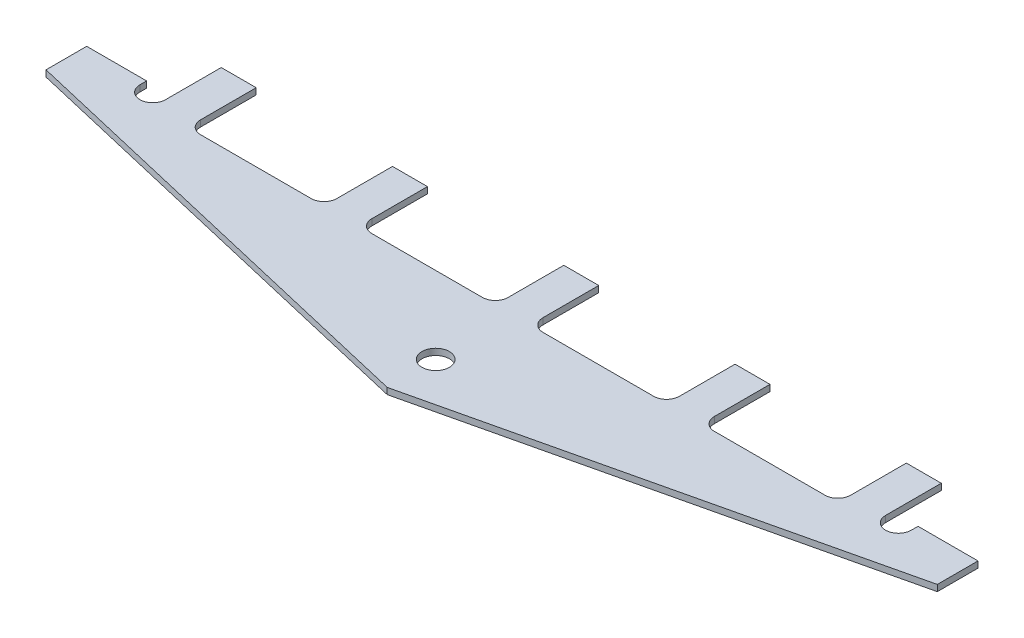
ISO-10303-21;
HEADER;
FILE_DESCRIPTION(('STEP AP214'),'2;1');
FILE_NAME('part.step','',(''),(''),'','','');
FILE_SCHEMA(('AUTOMOTIVE_DESIGN { 1 0 10303 214 1 1 1 1 }'));
ENDSEC;
DATA;
#1=APPLICATION_CONTEXT('core data for automotive mechanical design processes');
#2=APPLICATION_PROTOCOL_DEFINITION('international standard','automotive_design',2000,#1);
#3=PRODUCT_CONTEXT('',#1,'mechanical');
#4=PRODUCT('Part','Part','',(#3));
#5=PRODUCT_RELATED_PRODUCT_CATEGORY('part','',(#4));
#6=PRODUCT_DEFINITION_FORMATION('','',#4);
#7=PRODUCT_DEFINITION_CONTEXT('part definition',#1,'design');
#8=PRODUCT_DEFINITION('design','',#6,#7);
#9=PRODUCT_DEFINITION_SHAPE('','',#8);
#10=(LENGTH_UNIT() NAMED_UNIT(*) SI_UNIT(.MILLI.,.METRE.));
#11=(NAMED_UNIT(*) PLANE_ANGLE_UNIT() SI_UNIT($,.RADIAN.));
#12=(NAMED_UNIT(*) SI_UNIT($,.STERADIAN.) SOLID_ANGLE_UNIT());
#13=UNCERTAINTY_MEASURE_WITH_UNIT(LENGTH_MEASURE(1.E-05),#10,'distance_accuracy_value','');
#14=(GEOMETRIC_REPRESENTATION_CONTEXT(3) GLOBAL_UNCERTAINTY_ASSIGNED_CONTEXT((#13)) GLOBAL_UNIT_ASSIGNED_CONTEXT((#10,
#11,#12)) REPRESENTATION_CONTEXT('',''));
#15=CARTESIAN_POINT('',(0.,0.,0.));
#16=DIRECTION('',(0.,0.,1.));
#17=DIRECTION('',(1.,0.,0.));
#18=AXIS2_PLACEMENT_3D('',#15,#16,#17);
#19=CARTESIAN_POINT('',(-3.2385,-1.1684,-26.9875));
#20=DIRECTION('',(-1.,0.,0.));
#21=DIRECTION('',(0.,0.,1.));
#22=AXIS2_PLACEMENT_3D('',#19,#20,#21);
#23=PLANE('',#22);
#24=DIRECTION('',(0.,0.,1.));
#25=VECTOR('',#24,1.);
#26=CARTESIAN_POINT('',(-3.2385,0.,-26.9875));
#27=LINE('',#26,#25);
#28=CARTESIAN_POINT('',(-3.2385,0.,-26.9875));
#29=VERTEX_POINT('',#28);
#30=CARTESIAN_POINT('',(-3.2385,0.,-16.66875));
#31=VERTEX_POINT('',#30);
#32=EDGE_CURVE('E310',#29,#31,#27,.T.);
#33=ORIENTED_EDGE('',*,*,#32,.F.);
#34=DIRECTION('',(0.,1.,0.));
#35=VECTOR('',#34,1.);
#36=CARTESIAN_POINT('',(-3.2385,-1.1684,-26.9875));
#37=LINE('',#36,#35);
#38=CARTESIAN_POINT('',(-3.2385,-1.1684,-26.9875));
#39=VERTEX_POINT('',#38);
#40=EDGE_CURVE('E11',#39,#29,#37,.T.);
#41=ORIENTED_EDGE('',*,*,#40,.F.);
#42=DIRECTION('',(0.,0.,1.));
#43=VECTOR('',#42,1.);
#44=CARTESIAN_POINT('',(-3.2385,-1.1684,-26.9875));
#45=LINE('',#44,#43);
#46=CARTESIAN_POINT('',(-3.2385,-1.1684,-16.66875));
#47=VERTEX_POINT('',#46);
#48=EDGE_CURVE('E418',#39,#47,#45,.T.);
#49=ORIENTED_EDGE('',*,*,#48,.T.);
#50=DIRECTION('',(0.,1.,0.));
#51=VECTOR('',#50,1.);
#52=CARTESIAN_POINT('',(-3.2385,-1.1684,-16.66875));
#53=LINE('',#52,#51);
#54=EDGE_CURVE('E42',#47,#31,#53,.T.);
#55=ORIENTED_EDGE('',*,*,#54,.T.);
#56=EDGE_LOOP('',(#33,#41,#49,#55));
#57=FACE_BOUND('',#56,.T.);
#58=ADVANCED_FACE('F39',(#57),#23,.T.);
#59=CARTESIAN_POINT('',(-3.2385,-1.1684,-26.9875));
#60=DIRECTION('',(0.,0.,-1.));
#61=DIRECTION('',(-1.,0.,0.));
#62=AXIS2_PLACEMENT_3D('',#59,#60,#61);
#63=PLANE('',#62);
#64=DIRECTION('',(-1.,0.,0.));
#65=VECTOR('',#64,1.);
#66=CARTESIAN_POINT('',(-3.2385,0.,-26.9875));
#67=LINE('',#66,#65);
#68=CARTESIAN_POINT('',(3.2385,0.,-26.9875));
#69=VERTEX_POINT('',#68);
#70=EDGE_CURVE('E416',#69,#29,#67,.T.);
#71=ORIENTED_EDGE('',*,*,#70,.F.);
#72=DIRECTION('',(0.,1.,0.));
#73=VECTOR('',#72,1.);
#74=CARTESIAN_POINT('',(3.2385,-1.1684,-26.9875));
#75=LINE('',#74,#73);
#76=CARTESIAN_POINT('',(3.2385,-1.1684,-26.9875));
#77=VERTEX_POINT('',#76);
#78=EDGE_CURVE('E48',#77,#69,#75,.T.);
#79=ORIENTED_EDGE('',*,*,#78,.F.);
#80=DIRECTION('',(-1.,0.,0.));
#81=VECTOR('',#80,1.);
#82=CARTESIAN_POINT('',(-3.2385,-1.1684,-26.9875));
#83=LINE('',#82,#81);
#84=EDGE_CURVE('E300',#77,#39,#83,.T.);
#85=ORIENTED_EDGE('',*,*,#84,.T.);
#86=ORIENTED_EDGE('',*,*,#40,.T.);
#87=EDGE_LOOP('',(#71,#79,#85,#86));
#88=FACE_BOUND('',#87,.T.);
#89=ADVANCED_FACE('F488',(#88),#63,.T.);
#90=CARTESIAN_POINT('',(3.2385,-1.1684,-26.9875));
#91=DIRECTION('',(1.,0.,0.));
#92=DIRECTION('',(0.,0.,-1.));
#93=AXIS2_PLACEMENT_3D('',#90,#91,#92);
#94=PLANE('',#93);
#95=DIRECTION('',(0.,0.,-1.));
#96=VECTOR('',#95,1.);
#97=CARTESIAN_POINT('',(3.2385,0.,-26.9875));
#98=LINE('',#97,#96);
#99=CARTESIAN_POINT('',(3.2385,0.,-16.66875));
#100=VERTEX_POINT('',#99);
#101=EDGE_CURVE('E287',#100,#69,#98,.T.);
#102=ORIENTED_EDGE('',*,*,#101,.F.);
#103=DIRECTION('',(0.,1.,0.));
#104=VECTOR('',#103,1.);
#105=CARTESIAN_POINT('',(3.2385,-1.1684,-16.66875));
#106=LINE('',#105,#104);
#107=CARTESIAN_POINT('',(3.2385,-1.1684,-16.66875));
#108=VERTEX_POINT('',#107);
#109=EDGE_CURVE('E282',#108,#100,#106,.T.);
#110=ORIENTED_EDGE('',*,*,#109,.F.);
#111=DIRECTION('',(0.,0.,-1.));
#112=VECTOR('',#111,1.);
#113=CARTESIAN_POINT('',(3.2385,-1.1684,-26.9875));
#114=LINE('',#113,#112);
#115=EDGE_CURVE('E285',#108,#77,#114,.T.);
#116=ORIENTED_EDGE('',*,*,#115,.T.);
#117=ORIENTED_EDGE('',*,*,#78,.T.);
#118=EDGE_LOOP('',(#102,#110,#116,#117));
#119=FACE_BOUND('',#118,.T.);
#120=ADVANCED_FACE('F284',(#119),#94,.T.);
#121=CARTESIAN_POINT('',(5.61975,-1.1684,-16.66875));
#122=DIRECTION('',(0.,1.,0.));
#123=DIRECTION('',(0.,0.,1.));
#124=AXIS2_PLACEMENT_3D('',#121,#122,#123);
#125=CYLINDRICAL_SURFACE('',#124,2.38125);
#126=CARTESIAN_POINT('',(5.61975,0.,-16.66875));
#127=DIRECTION('',(0.,-1.,0.));
#128=DIRECTION('',(0.,0.,1.));
#129=AXIS2_PLACEMENT_3D('',#126,#127,#128);
#130=CIRCLE('',#129,2.38125);
#131=CARTESIAN_POINT('',(5.61975,0.,-14.2875));
#132=VERTEX_POINT('',#131);
#133=EDGE_CURVE('E413',#132,#100,#130,.T.);
#134=ORIENTED_EDGE('',*,*,#133,.F.);
#135=DIRECTION('',(0.,1.,0.));
#136=VECTOR('',#135,1.);
#137=CARTESIAN_POINT('',(5.61975,-1.1684,-14.2875));
#138=LINE('',#137,#136);
#139=CARTESIAN_POINT('',(5.61975,-1.1684,-14.2875));
#140=VERTEX_POINT('',#139);
#141=EDGE_CURVE('E292',#140,#132,#138,.T.);
#142=ORIENTED_EDGE('',*,*,#141,.F.);
#143=CARTESIAN_POINT('',(5.61975,-1.1684,-16.66875));
#144=DIRECTION('',(0.,-1.,0.));
#145=DIRECTION('',(0.,0.,1.));
#146=AXIS2_PLACEMENT_3D('',#143,#144,#145);
#147=CIRCLE('',#146,2.38125);
#148=EDGE_CURVE('E298',#140,#108,#147,.T.);
#149=ORIENTED_EDGE('',*,*,#148,.T.);
#150=ORIENTED_EDGE('',*,*,#109,.T.);
#151=EDGE_LOOP('',(#134,#142,#149,#150));
#152=FACE_BOUND('',#151,.T.);
#153=ADVANCED_FACE('F302',(#152),#125,.F.);
#154=CARTESIAN_POINT('',(5.61975,-1.1684,-14.2875));
#155=DIRECTION('',(0.,0.,-1.));
#156=DIRECTION('',(-1.,0.,0.));
#157=AXIS2_PLACEMENT_3D('',#154,#155,#156);
#158=PLANE('',#157);
#159=DIRECTION('',(-1.,0.,0.));
#160=VECTOR('',#159,1.);
#161=CARTESIAN_POINT('',(5.61975,0.,-14.2875));
#162=LINE('',#161,#160);
#163=CARTESIAN_POINT('',(26.13025,0.,-14.2875));
#164=VERTEX_POINT('',#163);
#165=EDGE_CURVE('E410',#164,#132,#162,.T.);
#166=ORIENTED_EDGE('',*,*,#165,.F.);
#167=DIRECTION('',(0.,1.,0.));
#168=VECTOR('',#167,1.);
#169=CARTESIAN_POINT('',(26.13025,-1.1684,-14.2875));
#170=LINE('',#169,#168);
#171=CARTESIAN_POINT('',(26.13025,-1.1684,-14.2875));
#172=VERTEX_POINT('',#171);
#173=EDGE_CURVE('E422',#172,#164,#170,.T.);
#174=ORIENTED_EDGE('',*,*,#173,.F.);
#175=DIRECTION('',(-1.,0.,0.));
#176=VECTOR('',#175,1.);
#177=CARTESIAN_POINT('',(5.61975,-1.1684,-14.2875));
#178=LINE('',#177,#176);
#179=EDGE_CURVE('E303',#172,#140,#178,.T.);
#180=ORIENTED_EDGE('',*,*,#179,.T.);
#181=ORIENTED_EDGE('',*,*,#141,.T.);
#182=EDGE_LOOP('',(#166,#174,#180,#181));
#183=FACE_BOUND('',#182,.T.);
#184=ADVANCED_FACE('F501',(#183),#158,.T.);
#185=CARTESIAN_POINT('',(26.13025,-1.1684,-16.66875));
#186=DIRECTION('',(0.,1.,0.));
#187=DIRECTION('',(0.,0.,1.));
#188=AXIS2_PLACEMENT_3D('',#185,#186,#187);
#189=CYLINDRICAL_SURFACE('',#188,2.38125);
#190=CARTESIAN_POINT('',(26.13025,0.,-16.66875));
#191=DIRECTION('',(0.,-1.,0.));
#192=DIRECTION('',(0.,0.,1.));
#193=AXIS2_PLACEMENT_3D('',#190,#191,#192);
#194=CIRCLE('',#193,2.38125);
#195=CARTESIAN_POINT('',(28.5115,0.,-16.66875));
#196=VERTEX_POINT('',#195);
#197=EDGE_CURVE('E407',#196,#164,#194,.T.);
#198=ORIENTED_EDGE('',*,*,#197,.F.);
#199=DIRECTION('',(0.,1.,0.));
#200=VECTOR('',#199,1.);
#201=CARTESIAN_POINT('',(28.5115,-1.1684,-16.66875));
#202=LINE('',#201,#200);
#203=CARTESIAN_POINT('',(28.5115,-1.1684,-16.66875));
#204=VERTEX_POINT('',#203);
#205=EDGE_CURVE('E424',#204,#196,#202,.T.);
#206=ORIENTED_EDGE('',*,*,#205,.F.);
#207=CARTESIAN_POINT('',(26.13025,-1.1684,-16.66875));
#208=DIRECTION('',(0.,-1.,0.));
#209=DIRECTION('',(0.,0.,1.));
#210=AXIS2_PLACEMENT_3D('',#207,#208,#209);
#211=CIRCLE('',#210,2.38125);
#212=EDGE_CURVE('E305',#204,#172,#211,.T.);
#213=ORIENTED_EDGE('',*,*,#212,.T.);
#214=ORIENTED_EDGE('',*,*,#173,.T.);
#215=EDGE_LOOP('',(#198,#206,#213,#214));
#216=FACE_BOUND('',#215,.T.);
#217=ADVANCED_FACE('F504',(#216),#189,.F.);
#218=CARTESIAN_POINT('',(28.5115,-1.1684,-16.66875));
#219=DIRECTION('',(-1.,0.,0.));
#220=DIRECTION('',(0.,0.,1.));
#221=AXIS2_PLACEMENT_3D('',#218,#219,#220);
#222=PLANE('',#221);
#223=DIRECTION('',(0.,0.,1.));
#224=VECTOR('',#223,1.);
#225=CARTESIAN_POINT('',(28.5115,0.,-16.66875));
#226=LINE('',#225,#224);
#227=CARTESIAN_POINT('',(28.5115,0.,-26.9875));
#228=VERTEX_POINT('',#227);
#229=EDGE_CURVE('E404',#228,#196,#226,.T.);
#230=ORIENTED_EDGE('',*,*,#229,.F.);
#231=DIRECTION('',(0.,1.,0.));
#232=VECTOR('',#231,1.);
#233=CARTESIAN_POINT('',(28.5115,-1.1684,-26.9875));
#234=LINE('',#233,#232);
#235=CARTESIAN_POINT('',(28.5115,-1.1684,-26.9875));
#236=VERTEX_POINT('',#235);
#237=EDGE_CURVE('E426',#236,#228,#234,.T.);
#238=ORIENTED_EDGE('',*,*,#237,.F.);
#239=DIRECTION('',(0.,0.,1.));
#240=VECTOR('',#239,1.);
#241=CARTESIAN_POINT('',(28.5115,-1.1684,-16.66875));
#242=LINE('',#241,#240);
#243=EDGE_CURVE('E742',#236,#204,#242,.T.);
#244=ORIENTED_EDGE('',*,*,#243,.T.);
#245=ORIENTED_EDGE('',*,*,#205,.T.);
#246=EDGE_LOOP('',(#230,#238,#244,#245));
#247=FACE_BOUND('',#246,.T.);
#248=ADVANCED_FACE('F508',(#247),#222,.T.);
#249=CARTESIAN_POINT('',(28.5115,-1.1684,-26.9875));
#250=DIRECTION('',(0.,0.,-1.));
#251=DIRECTION('',(-1.,0.,0.));
#252=AXIS2_PLACEMENT_3D('',#249,#250,#251);
#253=PLANE('',#252);
#254=DIRECTION('',(-1.,0.,0.));
#255=VECTOR('',#254,1.);
#256=CARTESIAN_POINT('',(28.5115,0.,-26.9875));
#257=LINE('',#256,#255);
#258=CARTESIAN_POINT('',(34.9885,0.,-26.9875));
#259=VERTEX_POINT('',#258);
#260=EDGE_CURVE('E401',#259,#228,#257,.T.);
#261=ORIENTED_EDGE('',*,*,#260,.F.);
#262=DIRECTION('',(0.,1.,0.));
#263=VECTOR('',#262,1.);
#264=CARTESIAN_POINT('',(34.9885,-1.1684,-26.9875));
#265=LINE('',#264,#263);
#266=CARTESIAN_POINT('',(34.9885,-1.1684,-26.9875));
#267=VERTEX_POINT('',#266);
#268=EDGE_CURVE('E428',#267,#259,#265,.T.);
#269=ORIENTED_EDGE('',*,*,#268,.F.);
#270=DIRECTION('',(-1.,0.,0.));
#271=VECTOR('',#270,1.);
#272=CARTESIAN_POINT('',(28.5115,-1.1684,-26.9875));
#273=LINE('',#272,#271);
#274=EDGE_CURVE('E739',#267,#236,#273,.T.);
#275=ORIENTED_EDGE('',*,*,#274,.T.);
#276=ORIENTED_EDGE('',*,*,#237,.T.);
#277=EDGE_LOOP('',(#261,#269,#275,#276));
#278=FACE_BOUND('',#277,.T.);
#279=ADVANCED_FACE('F512',(#278),#253,.T.);
#280=CARTESIAN_POINT('',(34.9885,-1.1684,-26.9875));
#281=DIRECTION('',(1.,0.,0.));
#282=DIRECTION('',(0.,0.,-1.));
#283=AXIS2_PLACEMENT_3D('',#280,#281,#282);
#284=PLANE('',#283);
#285=DIRECTION('',(0.,0.,-1.));
#286=VECTOR('',#285,1.);
#287=CARTESIAN_POINT('',(34.9885,0.,-26.9875));
#288=LINE('',#287,#286);
#289=CARTESIAN_POINT('',(34.9885,0.,-16.66875));
#290=VERTEX_POINT('',#289);
#291=EDGE_CURVE('E398',#290,#259,#288,.T.);
#292=ORIENTED_EDGE('',*,*,#291,.F.);
#293=DIRECTION('',(0.,1.,0.));
#294=VECTOR('',#293,1.);
#295=CARTESIAN_POINT('',(34.9885,-1.1684,-16.66875));
#296=LINE('',#295,#294);
#297=CARTESIAN_POINT('',(34.9885,-1.1684,-16.66875));
#298=VERTEX_POINT('',#297);
#299=EDGE_CURVE('E430',#298,#290,#296,.T.);
#300=ORIENTED_EDGE('',*,*,#299,.F.);
#301=DIRECTION('',(0.,0.,-1.));
#302=VECTOR('',#301,1.);
#303=CARTESIAN_POINT('',(34.9885,-1.1684,-26.9875));
#304=LINE('',#303,#302);
#305=EDGE_CURVE('E736',#298,#267,#304,.T.);
#306=ORIENTED_EDGE('',*,*,#305,.T.);
#307=ORIENTED_EDGE('',*,*,#268,.T.);
#308=EDGE_LOOP('',(#292,#300,#306,#307));
#309=FACE_BOUND('',#308,.T.);
#310=ADVANCED_FACE('F516',(#309),#284,.T.);
#311=CARTESIAN_POINT('',(37.36975,-1.1684,-16.66875));
#312=DIRECTION('',(0.,1.,0.));
#313=DIRECTION('',(0.,0.,1.));
#314=AXIS2_PLACEMENT_3D('',#311,#312,#313);
#315=CYLINDRICAL_SURFACE('',#314,2.38125);
#316=CARTESIAN_POINT('',(37.36975,0.,-16.66875));
#317=DIRECTION('',(0.,-1.,0.));
#318=DIRECTION('',(0.,0.,1.));
#319=AXIS2_PLACEMENT_3D('',#316,#317,#318);
#320=CIRCLE('',#319,2.38125);
#321=CARTESIAN_POINT('',(37.36975,0.,-14.2875));
#322=VERTEX_POINT('',#321);
#323=EDGE_CURVE('E395',#322,#290,#320,.T.);
#324=ORIENTED_EDGE('',*,*,#323,.F.);
#325=DIRECTION('',(0.,1.,0.));
#326=VECTOR('',#325,1.);
#327=CARTESIAN_POINT('',(37.36975,-1.1684,-14.2875));
#328=LINE('',#327,#326);
#329=CARTESIAN_POINT('',(37.36975,-1.1684,-14.2875));
#330=VERTEX_POINT('',#329);
#331=EDGE_CURVE('E432',#330,#322,#328,.T.);
#332=ORIENTED_EDGE('',*,*,#331,.F.);
#333=CARTESIAN_POINT('',(37.36975,-1.1684,-16.66875));
#334=DIRECTION('',(0.,-1.,0.));
#335=DIRECTION('',(0.,0.,1.));
#336=AXIS2_PLACEMENT_3D('',#333,#334,#335);
#337=CIRCLE('',#336,2.38125);
#338=EDGE_CURVE('E733',#330,#298,#337,.T.);
#339=ORIENTED_EDGE('',*,*,#338,.T.);
#340=ORIENTED_EDGE('',*,*,#299,.T.);
#341=EDGE_LOOP('',(#324,#332,#339,#340));
#342=FACE_BOUND('',#341,.T.);
#343=ADVANCED_FACE('F520',(#342),#315,.F.);
#344=CARTESIAN_POINT('',(37.36975,-1.1684,-14.2875));
#345=DIRECTION('',(0.,0.,-1.));
#346=DIRECTION('',(-1.,0.,0.));
#347=AXIS2_PLACEMENT_3D('',#344,#345,#346);
#348=PLANE('',#347);
#349=DIRECTION('',(-1.,0.,0.));
#350=VECTOR('',#349,1.);
#351=CARTESIAN_POINT('',(37.36975,0.,-14.2875));
#352=LINE('',#351,#350);
#353=CARTESIAN_POINT('',(57.88025,0.,-14.2875));
#354=VERTEX_POINT('',#353);
#355=EDGE_CURVE('E392',#354,#322,#352,.T.);
#356=ORIENTED_EDGE('',*,*,#355,.F.);
#357=DIRECTION('',(0.,1.,0.));
#358=VECTOR('',#357,1.);
#359=CARTESIAN_POINT('',(57.88025,-1.1684,-14.2875));
#360=LINE('',#359,#358);
#361=CARTESIAN_POINT('',(57.88025,-1.1684,-14.2875));
#362=VERTEX_POINT('',#361);
#363=EDGE_CURVE('E434',#362,#354,#360,.T.);
#364=ORIENTED_EDGE('',*,*,#363,.F.);
#365=DIRECTION('',(-1.,0.,0.));
#366=VECTOR('',#365,1.);
#367=CARTESIAN_POINT('',(37.36975,-1.1684,-14.2875));
#368=LINE('',#367,#366);
#369=EDGE_CURVE('E730',#362,#330,#368,.T.);
#370=ORIENTED_EDGE('',*,*,#369,.T.);
#371=ORIENTED_EDGE('',*,*,#331,.T.);
#372=EDGE_LOOP('',(#356,#364,#370,#371));
#373=FACE_BOUND('',#372,.T.);
#374=ADVANCED_FACE('F524',(#373),#348,.T.);
#375=CARTESIAN_POINT('',(57.88025,-1.1684,-16.66875));
#376=DIRECTION('',(0.,1.,0.));
#377=DIRECTION('',(0.,0.,1.));
#378=AXIS2_PLACEMENT_3D('',#375,#376,#377);
#379=CYLINDRICAL_SURFACE('',#378,2.38125);
#380=CARTESIAN_POINT('',(57.88025,0.,-16.66875));
#381=DIRECTION('',(0.,-1.,0.));
#382=DIRECTION('',(0.,0.,1.));
#383=AXIS2_PLACEMENT_3D('',#380,#381,#382);
#384=CIRCLE('',#383,2.38125);
#385=CARTESIAN_POINT('',(60.2615,0.,-16.66875));
#386=VERTEX_POINT('',#385);
#387=EDGE_CURVE('E389',#386,#354,#384,.T.);
#388=ORIENTED_EDGE('',*,*,#387,.F.);
#389=DIRECTION('',(0.,1.,0.));
#390=VECTOR('',#389,1.);
#391=CARTESIAN_POINT('',(60.2615,-1.1684,-16.66875));
#392=LINE('',#391,#390);
#393=CARTESIAN_POINT('',(60.2615,-1.1684,-16.66875));
#394=VERTEX_POINT('',#393);
#395=EDGE_CURVE('E436',#394,#386,#392,.T.);
#396=ORIENTED_EDGE('',*,*,#395,.F.);
#397=CARTESIAN_POINT('',(57.88025,-1.1684,-16.66875));
#398=DIRECTION('',(0.,-1.,0.));
#399=DIRECTION('',(0.,0.,1.));
#400=AXIS2_PLACEMENT_3D('',#397,#398,#399);
#401=CIRCLE('',#400,2.38125);
#402=EDGE_CURVE('E727',#394,#362,#401,.T.);
#403=ORIENTED_EDGE('',*,*,#402,.T.);
#404=ORIENTED_EDGE('',*,*,#363,.T.);
#405=EDGE_LOOP('',(#388,#396,#403,#404));
#406=FACE_BOUND('',#405,.T.);
#407=ADVANCED_FACE('F528',(#406),#379,.F.);
#408=CARTESIAN_POINT('',(60.2615,-1.1684,-16.66875));
#409=DIRECTION('',(-1.,0.,0.));
#410=DIRECTION('',(0.,0.,1.));
#411=AXIS2_PLACEMENT_3D('',#408,#409,#410);
#412=PLANE('',#411);
#413=DIRECTION('',(0.,0.,1.));
#414=VECTOR('',#413,1.);
#415=CARTESIAN_POINT('',(60.2615,0.,-16.66875));
#416=LINE('',#415,#414);
#417=CARTESIAN_POINT('',(60.2615,0.,-26.9875));
#418=VERTEX_POINT('',#417);
#419=EDGE_CURVE('E386',#418,#386,#416,.T.);
#420=ORIENTED_EDGE('',*,*,#419,.F.);
#421=DIRECTION('',(0.,1.,0.));
#422=VECTOR('',#421,1.);
#423=CARTESIAN_POINT('',(60.2615,-1.1684,-26.9875));
#424=LINE('',#423,#422);
#425=CARTESIAN_POINT('',(60.2615,-1.1684,-26.9875));
#426=VERTEX_POINT('',#425);
#427=EDGE_CURVE('E438',#426,#418,#424,.T.);
#428=ORIENTED_EDGE('',*,*,#427,.F.);
#429=DIRECTION('',(0.,0.,1.));
#430=VECTOR('',#429,1.);
#431=CARTESIAN_POINT('',(60.2615,-1.1684,-16.66875));
#432=LINE('',#431,#430);
#433=EDGE_CURVE('E724',#426,#394,#432,.T.);
#434=ORIENTED_EDGE('',*,*,#433,.T.);
#435=ORIENTED_EDGE('',*,*,#395,.T.);
#436=EDGE_LOOP('',(#420,#428,#434,#435));
#437=FACE_BOUND('',#436,.T.);
#438=ADVANCED_FACE('F532',(#437),#412,.T.);
#439=CARTESIAN_POINT('',(60.2615,-1.1684,-26.9875));
#440=DIRECTION('',(0.,0.,-1.));
#441=DIRECTION('',(-1.,0.,0.));
#442=AXIS2_PLACEMENT_3D('',#439,#440,#441);
#443=PLANE('',#442);
#444=DIRECTION('',(-1.,0.,0.));
#445=VECTOR('',#444,1.);
#446=CARTESIAN_POINT('',(60.2615,0.,-26.9875));
#447=LINE('',#446,#445);
#448=CARTESIAN_POINT('',(66.7385,0.,-26.9875));
#449=VERTEX_POINT('',#448);
#450=EDGE_CURVE('E383',#449,#418,#447,.T.);
#451=ORIENTED_EDGE('',*,*,#450,.F.);
#452=DIRECTION('',(0.,1.,0.));
#453=VECTOR('',#452,1.);
#454=CARTESIAN_POINT('',(66.7385,-1.1684,-26.9875));
#455=LINE('',#454,#453);
#456=CARTESIAN_POINT('',(66.7385,-1.1684,-26.9875));
#457=VERTEX_POINT('',#456);
#458=EDGE_CURVE('E440',#457,#449,#455,.T.);
#459=ORIENTED_EDGE('',*,*,#458,.F.);
#460=DIRECTION('',(-1.,0.,0.));
#461=VECTOR('',#460,1.);
#462=CARTESIAN_POINT('',(60.2615,-1.1684,-26.9875));
#463=LINE('',#462,#461);
#464=EDGE_CURVE('E721',#457,#426,#463,.T.);
#465=ORIENTED_EDGE('',*,*,#464,.T.);
#466=ORIENTED_EDGE('',*,*,#427,.T.);
#467=EDGE_LOOP('',(#451,#459,#465,#466));
#468=FACE_BOUND('',#467,.T.);
#469=ADVANCED_FACE('F536',(#468),#443,.T.);
#470=CARTESIAN_POINT('',(66.7385,-1.1684,-26.9875));
#471=DIRECTION('',(1.,0.,0.));
#472=DIRECTION('',(0.,0.,-1.));
#473=AXIS2_PLACEMENT_3D('',#470,#471,#472);
#474=PLANE('',#473);
#475=DIRECTION('',(0.,0.,-1.));
#476=VECTOR('',#475,1.);
#477=CARTESIAN_POINT('',(66.7385,0.,-26.9875));
#478=LINE('',#477,#476);
#479=CARTESIAN_POINT('',(66.7385,0.,-16.66875));
#480=VERTEX_POINT('',#479);
#481=EDGE_CURVE('E380',#480,#449,#478,.T.);
#482=ORIENTED_EDGE('',*,*,#481,.F.);
#483=DIRECTION('',(0.,1.,0.));
#484=VECTOR('',#483,1.);
#485=CARTESIAN_POINT('',(66.7385,-1.1684,-16.66875));
#486=LINE('',#485,#484);
#487=CARTESIAN_POINT('',(66.7385,-1.1684,-16.66875));
#488=VERTEX_POINT('',#487);
#489=EDGE_CURVE('E442',#488,#480,#486,.T.);
#490=ORIENTED_EDGE('',*,*,#489,.F.);
#491=DIRECTION('',(0.,0.,-1.));
#492=VECTOR('',#491,1.);
#493=CARTESIAN_POINT('',(66.7385,-1.1684,-26.9875));
#494=LINE('',#493,#492);
#495=EDGE_CURVE('E718',#488,#457,#494,.T.);
#496=ORIENTED_EDGE('',*,*,#495,.T.);
#497=ORIENTED_EDGE('',*,*,#458,.T.);
#498=EDGE_LOOP('',(#482,#490,#496,#497));
#499=FACE_BOUND('',#498,.T.);
#500=ADVANCED_FACE('F540',(#499),#474,.T.);
#501=CARTESIAN_POINT('',(69.11975,-1.1684,-16.66875));
#502=DIRECTION('',(0.,1.,0.));
#503=DIRECTION('',(0.,0.,1.));
#504=AXIS2_PLACEMENT_3D('',#501,#502,#503);
#505=CYLINDRICAL_SURFACE('',#504,2.38125);
#506=CARTESIAN_POINT('',(69.11975,0.,-16.66875));
#507=DIRECTION('',(0.,-1.,0.));
#508=DIRECTION('',(0.,0.,1.));
#509=AXIS2_PLACEMENT_3D('',#506,#507,#508);
#510=CIRCLE('',#509,2.38125);
#511=CARTESIAN_POINT('',(71.501,0.,-16.66875));
#512=VERTEX_POINT('',#511);
#513=EDGE_CURVE('E377',#512,#480,#510,.T.);
#514=ORIENTED_EDGE('',*,*,#513,.F.);
#515=DIRECTION('',(0.,1.,0.));
#516=VECTOR('',#515,1.);
#517=CARTESIAN_POINT('',(71.501,-1.1684,-16.66875));
#518=LINE('',#517,#516);
#519=CARTESIAN_POINT('',(71.501,-1.1684,-16.66875));
#520=VERTEX_POINT('',#519);
#521=EDGE_CURVE('E444',#520,#512,#518,.T.);
#522=ORIENTED_EDGE('',*,*,#521,.F.);
#523=CARTESIAN_POINT('',(69.11975,-1.1684,-16.66875));
#524=DIRECTION('',(0.,-1.,0.));
#525=DIRECTION('',(0.,0.,1.));
#526=AXIS2_PLACEMENT_3D('',#523,#524,#525);
#527=CIRCLE('',#526,2.38125);
#528=EDGE_CURVE('E715',#520,#488,#527,.T.);
#529=ORIENTED_EDGE('',*,*,#528,.T.);
#530=ORIENTED_EDGE('',*,*,#489,.T.);
#531=EDGE_LOOP('',(#514,#522,#529,#530));
#532=FACE_BOUND('',#531,.T.);
#533=ADVANCED_FACE('F544',(#532),#505,.F.);
#534=CARTESIAN_POINT('',(71.501,-1.1684,-16.66875));
#535=DIRECTION('',(-1.,0.,0.));
#536=DIRECTION('',(0.,0.,1.));
#537=AXIS2_PLACEMENT_3D('',#534,#535,#536);
#538=PLANE('',#537);
#539=DIRECTION('',(0.,0.,1.));
#540=VECTOR('',#539,1.);
#541=CARTESIAN_POINT('',(71.501,0.,-16.66875));
#542=LINE('',#541,#540);
#543=CARTESIAN_POINT('',(71.501,0.,-17.9197));
#544=VERTEX_POINT('',#543);
#545=EDGE_CURVE('E374',#544,#512,#542,.T.);
#546=ORIENTED_EDGE('',*,*,#545,.F.);
#547=DIRECTION('',(0.,1.,0.));
#548=VECTOR('',#547,1.);
#549=CARTESIAN_POINT('',(71.501,-1.1684,-17.9197));
#550=LINE('',#549,#548);
#551=CARTESIAN_POINT('',(71.501,-1.1684,-17.9197));
#552=VERTEX_POINT('',#551);
#553=EDGE_CURVE('E446',#552,#544,#550,.T.);
#554=ORIENTED_EDGE('',*,*,#553,.F.);
#555=DIRECTION('',(0.,0.,1.));
#556=VECTOR('',#555,1.);
#557=CARTESIAN_POINT('',(71.501,-1.1684,-16.66875));
#558=LINE('',#557,#556);
#559=EDGE_CURVE('E712',#552,#520,#558,.T.);
#560=ORIENTED_EDGE('',*,*,#559,.T.);
#561=ORIENTED_EDGE('',*,*,#521,.T.);
#562=EDGE_LOOP('',(#546,#554,#560,#561));
#563=FACE_BOUND('',#562,.T.);
#564=ADVANCED_FACE('F548',(#563),#538,.T.);
#565=CARTESIAN_POINT('',(71.501,-1.1684,-17.9197));
#566=DIRECTION('',(0.,0.,-1.));
#567=DIRECTION('',(-1.,0.,0.));
#568=AXIS2_PLACEMENT_3D('',#565,#566,#567);
#569=PLANE('',#568);
#570=DIRECTION('',(-1.,0.,0.));
#571=VECTOR('',#570,1.);
#572=CARTESIAN_POINT('',(71.501,0.,-17.9197));
#573=LINE('',#572,#571);
#574=CARTESIAN_POINT('',(82.6135,0.,-17.9197));
#575=VERTEX_POINT('',#574);
#576=EDGE_CURVE('E371',#575,#544,#573,.T.);
#577=ORIENTED_EDGE('',*,*,#576,.F.);
#578=DIRECTION('',(0.,1.,0.));
#579=VECTOR('',#578,1.);
#580=CARTESIAN_POINT('',(82.6135,-1.1684,-17.9197));
#581=LINE('',#580,#579);
#582=CARTESIAN_POINT('',(82.6135,-1.1684,-17.9197));
#583=VERTEX_POINT('',#582);
#584=EDGE_CURVE('E448',#583,#575,#581,.T.);
#585=ORIENTED_EDGE('',*,*,#584,.F.);
#586=DIRECTION('',(-1.,0.,0.));
#587=VECTOR('',#586,1.);
#588=CARTESIAN_POINT('',(71.501,-1.1684,-17.9197));
#589=LINE('',#588,#587);
#590=EDGE_CURVE('E709',#583,#552,#589,.T.);
#591=ORIENTED_EDGE('',*,*,#590,.T.);
#592=ORIENTED_EDGE('',*,*,#553,.T.);
#593=EDGE_LOOP('',(#577,#585,#591,#592));
#594=FACE_BOUND('',#593,.T.);
#595=ADVANCED_FACE('F552',(#594),#569,.T.);
#596=CARTESIAN_POINT('',(82.6135,-1.1684,-17.9197));
#597=DIRECTION('',(1.,0.,0.));
#598=DIRECTION('',(0.,0.,-1.));
#599=AXIS2_PLACEMENT_3D('',#596,#597,#598);
#600=PLANE('',#599);
#601=DIRECTION('',(0.,0.,-1.));
#602=VECTOR('',#601,1.);
#603=CARTESIAN_POINT('',(82.6135,0.,-17.9197));
#604=LINE('',#603,#602);
#605=CARTESIAN_POINT('',(82.6135,0.,-10.3759));
#606=VERTEX_POINT('',#605);
#607=EDGE_CURVE('E368',#606,#575,#604,.T.);
#608=ORIENTED_EDGE('',*,*,#607,.F.);
#609=DIRECTION('',(0.,1.,0.));
#610=VECTOR('',#609,1.);
#611=CARTESIAN_POINT('',(82.6135,-1.1684,-10.3759));
#612=LINE('',#611,#610);
#613=CARTESIAN_POINT('',(82.6135,-1.1684,-10.3759));
#614=VERTEX_POINT('',#613);
#615=EDGE_CURVE('E450',#614,#606,#612,.T.);
#616=ORIENTED_EDGE('',*,*,#615,.F.);
#617=DIRECTION('',(0.,0.,-1.));
#618=VECTOR('',#617,1.);
#619=CARTESIAN_POINT('',(82.6135,-1.1684,-17.9197));
#620=LINE('',#619,#618);
#621=EDGE_CURVE('E706',#614,#583,#620,.T.);
#622=ORIENTED_EDGE('',*,*,#621,.T.);
#623=ORIENTED_EDGE('',*,*,#584,.T.);
#624=EDGE_LOOP('',(#608,#616,#622,#623));
#625=FACE_BOUND('',#624,.T.);
#626=ADVANCED_FACE('F556',(#625),#600,.T.);
#627=CARTESIAN_POINT('',(0.,-1.1684,8.9789));
#628=DIRECTION('',(0.228104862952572,0.,0.973636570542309));
#629=DIRECTION('',(0.973636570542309,0.,-0.228104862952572));
#630=AXIS2_PLACEMENT_3D('',#627,#628,#629);
#631=PLANE('',#630);
#632=DIRECTION('',(0.973636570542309,0.,-0.228104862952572));
#633=VECTOR('',#632,1.);
#634=CARTESIAN_POINT('',(0.,0.,8.9789));
#635=LINE('',#634,#633);
#636=CARTESIAN_POINT('',(0.,0.,8.9789));
#637=VERTEX_POINT('',#636);
#638=EDGE_CURVE('E365',#637,#606,#635,.T.);
#639=ORIENTED_EDGE('',*,*,#638,.F.);
#640=DIRECTION('',(0.,1.,0.));
#641=VECTOR('',#640,1.);
#642=CARTESIAN_POINT('',(0.,-1.1684,8.9789));
#643=LINE('',#642,#641);
#644=CARTESIAN_POINT('',(0.,-1.1684,8.9789));
#645=VERTEX_POINT('',#644);
#646=EDGE_CURVE('E452',#645,#637,#643,.T.);
#647=ORIENTED_EDGE('',*,*,#646,.F.);
#648=DIRECTION('',(0.973636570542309,0.,-0.228104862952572));
#649=VECTOR('',#648,1.);
#650=CARTESIAN_POINT('',(0.,-1.1684,8.9789));
#651=LINE('',#650,#649);
#652=EDGE_CURVE('E703',#645,#614,#651,.T.);
#653=ORIENTED_EDGE('',*,*,#652,.T.);
#654=ORIENTED_EDGE('',*,*,#615,.T.);
#655=EDGE_LOOP('',(#639,#647,#653,#654));
#656=FACE_BOUND('',#655,.T.);
#657=ADVANCED_FACE('F560',(#656),#631,.T.);
#658=CARTESIAN_POINT('',(0.,-1.1684,8.9789));
#659=DIRECTION('',(-0.228104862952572,0.,0.973636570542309));
#660=DIRECTION('',(0.973636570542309,0.,0.228104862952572));
#661=AXIS2_PLACEMENT_3D('',#658,#659,#660);
#662=PLANE('',#661);
#663=DIRECTION('',(0.973636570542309,0.,0.228104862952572));
#664=VECTOR('',#663,1.);
#665=CARTESIAN_POINT('',(0.,0.,8.9789));
#666=LINE('',#665,#664);
#667=CARTESIAN_POINT('',(-82.6135,0.,-10.3759));
#668=VERTEX_POINT('',#667);
#669=EDGE_CURVE('E362',#668,#637,#666,.T.);
#670=ORIENTED_EDGE('',*,*,#669,.F.);
#671=DIRECTION('',(0.,1.,0.));
#672=VECTOR('',#671,1.);
#673=CARTESIAN_POINT('',(-82.6135,-1.1684,-10.3759));
#674=LINE('',#673,#672);
#675=CARTESIAN_POINT('',(-82.6135,-1.1684,-10.3759));
#676=VERTEX_POINT('',#675);
#677=EDGE_CURVE('E454',#676,#668,#674,.T.);
#678=ORIENTED_EDGE('',*,*,#677,.F.);
#679=DIRECTION('',(0.973636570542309,0.,0.228104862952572));
#680=VECTOR('',#679,1.);
#681=CARTESIAN_POINT('',(0.,-1.1684,8.9789));
#682=LINE('',#681,#680);
#683=EDGE_CURVE('E700',#676,#645,#682,.T.);
#684=ORIENTED_EDGE('',*,*,#683,.T.);
#685=ORIENTED_EDGE('',*,*,#646,.T.);
#686=EDGE_LOOP('',(#670,#678,#684,#685));
#687=FACE_BOUND('',#686,.T.);
#688=ADVANCED_FACE('F564',(#687),#662,.T.);
#689=CARTESIAN_POINT('',(-82.6135,-1.1684,-17.9197));
#690=DIRECTION('',(-1.,0.,0.));
#691=DIRECTION('',(0.,0.,1.));
#692=AXIS2_PLACEMENT_3D('',#689,#690,#691);
#693=PLANE('',#692);
#694=DIRECTION('',(0.,0.,1.));
#695=VECTOR('',#694,1.);
#696=CARTESIAN_POINT('',(-82.6135,0.,-17.9197));
#697=LINE('',#696,#695);
#698=CARTESIAN_POINT('',(-82.6135,0.,-17.9197));
#699=VERTEX_POINT('',#698);
#700=EDGE_CURVE('E359',#699,#668,#697,.T.);
#701=ORIENTED_EDGE('',*,*,#700,.F.);
#702=DIRECTION('',(0.,1.,0.));
#703=VECTOR('',#702,1.);
#704=CARTESIAN_POINT('',(-82.6135,-1.1684,-17.9197));
#705=LINE('',#704,#703);
#706=CARTESIAN_POINT('',(-82.6135,-1.1684,-17.9197));
#707=VERTEX_POINT('',#706);
#708=EDGE_CURVE('E456',#707,#699,#705,.T.);
#709=ORIENTED_EDGE('',*,*,#708,.F.);
#710=DIRECTION('',(0.,0.,1.));
#711=VECTOR('',#710,1.);
#712=CARTESIAN_POINT('',(-82.6135,-1.1684,-17.9197));
#713=LINE('',#712,#711);
#714=EDGE_CURVE('E697',#707,#676,#713,.T.);
#715=ORIENTED_EDGE('',*,*,#714,.T.);
#716=ORIENTED_EDGE('',*,*,#677,.T.);
#717=EDGE_LOOP('',(#701,#709,#715,#716));
#718=FACE_BOUND('',#717,.T.);
#719=ADVANCED_FACE('F568',(#718),#693,.T.);
#720=CARTESIAN_POINT('',(-71.501,-1.1684,-17.9197));
#721=DIRECTION('',(0.,0.,-1.));
#722=DIRECTION('',(-1.,0.,0.));
#723=AXIS2_PLACEMENT_3D('',#720,#721,#722);
#724=PLANE('',#723);
#725=DIRECTION('',(-1.,0.,0.));
#726=VECTOR('',#725,1.);
#727=CARTESIAN_POINT('',(-71.501,0.,-17.9197));
#728=LINE('',#727,#726);
#729=CARTESIAN_POINT('',(-71.501,0.,-17.9197));
#730=VERTEX_POINT('',#729);
#731=EDGE_CURVE('E356',#730,#699,#728,.T.);
#732=ORIENTED_EDGE('',*,*,#731,.F.);
#733=DIRECTION('',(0.,1.,0.));
#734=VECTOR('',#733,1.);
#735=CARTESIAN_POINT('',(-71.501,-1.1684,-17.9197));
#736=LINE('',#735,#734);
#737=CARTESIAN_POINT('',(-71.501,-1.1684,-17.9197));
#738=VERTEX_POINT('',#737);
#739=EDGE_CURVE('E458',#738,#730,#736,.T.);
#740=ORIENTED_EDGE('',*,*,#739,.F.);
#741=DIRECTION('',(-1.,0.,0.));
#742=VECTOR('',#741,1.);
#743=CARTESIAN_POINT('',(-71.501,-1.1684,-17.9197));
#744=LINE('',#743,#742);
#745=EDGE_CURVE('E694',#738,#707,#744,.T.);
#746=ORIENTED_EDGE('',*,*,#745,.T.);
#747=ORIENTED_EDGE('',*,*,#708,.T.);
#748=EDGE_LOOP('',(#732,#740,#746,#747));
#749=FACE_BOUND('',#748,.T.);
#750=ADVANCED_FACE('F572',(#749),#724,.T.);
#751=CARTESIAN_POINT('',(-71.501,-1.1684,-16.66875));
#752=DIRECTION('',(1.,0.,0.));
#753=DIRECTION('',(0.,0.,-1.));
#754=AXIS2_PLACEMENT_3D('',#751,#752,#753);
#755=PLANE('',#754);
#756=DIRECTION('',(0.,0.,-1.));
#757=VECTOR('',#756,1.);
#758=CARTESIAN_POINT('',(-71.501,0.,-16.66875));
#759=LINE('',#758,#757);
#760=CARTESIAN_POINT('',(-71.501,0.,-16.66875));
#761=VERTEX_POINT('',#760);
#762=EDGE_CURVE('E353',#761,#730,#759,.T.);
#763=ORIENTED_EDGE('',*,*,#762,.F.);
#764=DIRECTION('',(0.,1.,0.));
#765=VECTOR('',#764,1.);
#766=CARTESIAN_POINT('',(-71.501,-1.1684,-16.66875));
#767=LINE('',#766,#765);
#768=CARTESIAN_POINT('',(-71.501,-1.1684,-16.66875));
#769=VERTEX_POINT('',#768);
#770=EDGE_CURVE('E460',#769,#761,#767,.T.);
#771=ORIENTED_EDGE('',*,*,#770,.F.);
#772=DIRECTION('',(0.,0.,-1.));
#773=VECTOR('',#772,1.);
#774=CARTESIAN_POINT('',(-71.501,-1.1684,-16.66875));
#775=LINE('',#774,#773);
#776=EDGE_CURVE('E691',#769,#738,#775,.T.);
#777=ORIENTED_EDGE('',*,*,#776,.T.);
#778=ORIENTED_EDGE('',*,*,#739,.T.);
#779=EDGE_LOOP('',(#763,#771,#777,#778));
#780=FACE_BOUND('',#779,.T.);
#781=ADVANCED_FACE('F576',(#780),#755,.T.);
#782=CARTESIAN_POINT('',(-69.11975,-1.1684,-16.66875));
#783=DIRECTION('',(0.,1.,0.));
#784=DIRECTION('',(0.,0.,1.));
#785=AXIS2_PLACEMENT_3D('',#782,#783,#784);
#786=CYLINDRICAL_SURFACE('',#785,2.38125);
#787=CARTESIAN_POINT('',(-69.11975,0.,-16.66875));
#788=DIRECTION('',(0.,-1.,0.));
#789=DIRECTION('',(0.,0.,-1.));
#790=AXIS2_PLACEMENT_3D('',#787,#788,#789);
#791=CIRCLE('',#790,2.38125);
#792=CARTESIAN_POINT('',(-66.7385,0.,-16.66875));
#793=VERTEX_POINT('',#792);
#794=EDGE_CURVE('E350',#793,#761,#791,.T.);
#795=ORIENTED_EDGE('',*,*,#794,.F.);
#796=DIRECTION('',(0.,1.,0.));
#797=VECTOR('',#796,1.);
#798=CARTESIAN_POINT('',(-66.7385,-1.1684,-16.66875));
#799=LINE('',#798,#797);
#800=CARTESIAN_POINT('',(-66.7385,-1.1684,-16.66875));
#801=VERTEX_POINT('',#800);
#802=EDGE_CURVE('E462',#801,#793,#799,.T.);
#803=ORIENTED_EDGE('',*,*,#802,.F.);
#804=CARTESIAN_POINT('',(-69.11975,-1.1684,-16.66875));
#805=DIRECTION('',(0.,-1.,0.));
#806=DIRECTION('',(0.,0.,-1.));
#807=AXIS2_PLACEMENT_3D('',#804,#805,#806);
#808=CIRCLE('',#807,2.38125);
#809=EDGE_CURVE('E688',#801,#769,#808,.T.);
#810=ORIENTED_EDGE('',*,*,#809,.T.);
#811=ORIENTED_EDGE('',*,*,#770,.T.);
#812=EDGE_LOOP('',(#795,#803,#810,#811));
#813=FACE_BOUND('',#812,.T.);
#814=ADVANCED_FACE('F580',(#813),#786,.F.);
#815=CARTESIAN_POINT('',(-66.7385,-1.1684,-26.9875));
#816=DIRECTION('',(-1.,0.,0.));
#817=DIRECTION('',(0.,0.,1.));
#818=AXIS2_PLACEMENT_3D('',#815,#816,#817);
#819=PLANE('',#818);
#820=DIRECTION('',(0.,0.,1.));
#821=VECTOR('',#820,1.);
#822=CARTESIAN_POINT('',(-66.7385,0.,-26.9875));
#823=LINE('',#822,#821);
#824=CARTESIAN_POINT('',(-66.7385,0.,-26.9875));
#825=VERTEX_POINT('',#824);
#826=EDGE_CURVE('E347',#825,#793,#823,.T.);
#827=ORIENTED_EDGE('',*,*,#826,.F.);
#828=DIRECTION('',(0.,1.,0.));
#829=VECTOR('',#828,1.);
#830=CARTESIAN_POINT('',(-66.7385,-1.1684,-26.9875));
#831=LINE('',#830,#829);
#832=CARTESIAN_POINT('',(-66.7385,-1.1684,-26.9875));
#833=VERTEX_POINT('',#832);
#834=EDGE_CURVE('E464',#833,#825,#831,.T.);
#835=ORIENTED_EDGE('',*,*,#834,.F.);
#836=DIRECTION('',(0.,0.,1.));
#837=VECTOR('',#836,1.);
#838=CARTESIAN_POINT('',(-66.7385,-1.1684,-26.9875));
#839=LINE('',#838,#837);
#840=EDGE_CURVE('E685',#833,#801,#839,.T.);
#841=ORIENTED_EDGE('',*,*,#840,.T.);
#842=ORIENTED_EDGE('',*,*,#802,.T.);
#843=EDGE_LOOP('',(#827,#835,#841,#842));
#844=FACE_BOUND('',#843,.T.);
#845=ADVANCED_FACE('F584',(#844),#819,.T.);
#846=CARTESIAN_POINT('',(-60.2615,-1.1684,-26.9875));
#847=DIRECTION('',(0.,0.,-1.));
#848=DIRECTION('',(-1.,0.,0.));
#849=AXIS2_PLACEMENT_3D('',#846,#847,#848);
#850=PLANE('',#849);
#851=DIRECTION('',(-1.,0.,0.));
#852=VECTOR('',#851,1.);
#853=CARTESIAN_POINT('',(-60.2615,0.,-26.9875));
#854=LINE('',#853,#852);
#855=CARTESIAN_POINT('',(-60.2615,0.,-26.9875));
#856=VERTEX_POINT('',#855);
#857=EDGE_CURVE('E344',#856,#825,#854,.T.);
#858=ORIENTED_EDGE('',*,*,#857,.F.);
#859=DIRECTION('',(0.,1.,0.));
#860=VECTOR('',#859,1.);
#861=CARTESIAN_POINT('',(-60.2615,-1.1684,-26.9875));
#862=LINE('',#861,#860);
#863=CARTESIAN_POINT('',(-60.2615,-1.1684,-26.9875));
#864=VERTEX_POINT('',#863);
#865=EDGE_CURVE('E466',#864,#856,#862,.T.);
#866=ORIENTED_EDGE('',*,*,#865,.F.);
#867=DIRECTION('',(-1.,0.,0.));
#868=VECTOR('',#867,1.);
#869=CARTESIAN_POINT('',(-60.2615,-1.1684,-26.9875));
#870=LINE('',#869,#868);
#871=EDGE_CURVE('E682',#864,#833,#870,.T.);
#872=ORIENTED_EDGE('',*,*,#871,.T.);
#873=ORIENTED_EDGE('',*,*,#834,.T.);
#874=EDGE_LOOP('',(#858,#866,#872,#873));
#875=FACE_BOUND('',#874,.T.);
#876=ADVANCED_FACE('F588',(#875),#850,.T.);
#877=CARTESIAN_POINT('',(-60.2615,-1.1684,-16.66875));
#878=DIRECTION('',(1.,0.,0.));
#879=DIRECTION('',(0.,0.,-1.));
#880=AXIS2_PLACEMENT_3D('',#877,#878,#879);
#881=PLANE('',#880);
#882=DIRECTION('',(0.,0.,-1.));
#883=VECTOR('',#882,1.);
#884=CARTESIAN_POINT('',(-60.2615,0.,-16.66875));
#885=LINE('',#884,#883);
#886=CARTESIAN_POINT('',(-60.2615,0.,-16.66875));
#887=VERTEX_POINT('',#886);
#888=EDGE_CURVE('E341',#887,#856,#885,.T.);
#889=ORIENTED_EDGE('',*,*,#888,.F.);
#890=DIRECTION('',(0.,1.,0.));
#891=VECTOR('',#890,1.);
#892=CARTESIAN_POINT('',(-60.2615,-1.1684,-16.66875));
#893=LINE('',#892,#891);
#894=CARTESIAN_POINT('',(-60.2615,-1.1684,-16.66875));
#895=VERTEX_POINT('',#894);
#896=EDGE_CURVE('E468',#895,#887,#893,.T.);
#897=ORIENTED_EDGE('',*,*,#896,.F.);
#898=DIRECTION('',(0.,0.,-1.));
#899=VECTOR('',#898,1.);
#900=CARTESIAN_POINT('',(-60.2615,-1.1684,-16.66875));
#901=LINE('',#900,#899);
#902=EDGE_CURVE('E679',#895,#864,#901,.T.);
#903=ORIENTED_EDGE('',*,*,#902,.T.);
#904=ORIENTED_EDGE('',*,*,#865,.T.);
#905=EDGE_LOOP('',(#889,#897,#903,#904));
#906=FACE_BOUND('',#905,.T.);
#907=ADVANCED_FACE('F592',(#906),#881,.T.);
#908=CARTESIAN_POINT('',(-57.88025,-1.1684,-16.66875));
#909=DIRECTION('',(0.,1.,0.));
#910=DIRECTION('',(0.,0.,1.));
#911=AXIS2_PLACEMENT_3D('',#908,#909,#910);
#912=CYLINDRICAL_SURFACE('',#911,2.38125);
#913=CARTESIAN_POINT('',(-57.88025,0.,-16.66875));
#914=DIRECTION('',(0.,-1.,0.));
#915=DIRECTION('',(0.,0.,-1.));
#916=AXIS2_PLACEMENT_3D('',#913,#914,#915);
#917=CIRCLE('',#916,2.38125);
#918=CARTESIAN_POINT('',(-57.88025,0.,-14.2875));
#919=VERTEX_POINT('',#918);
#920=EDGE_CURVE('E338',#919,#887,#917,.T.);
#921=ORIENTED_EDGE('',*,*,#920,.F.);
#922=DIRECTION('',(0.,1.,0.));
#923=VECTOR('',#922,1.);
#924=CARTESIAN_POINT('',(-57.88025,-1.1684,-14.2875));
#925=LINE('',#924,#923);
#926=CARTESIAN_POINT('',(-57.88025,-1.1684,-14.2875));
#927=VERTEX_POINT('',#926);
#928=EDGE_CURVE('E470',#927,#919,#925,.T.);
#929=ORIENTED_EDGE('',*,*,#928,.F.);
#930=CARTESIAN_POINT('',(-57.88025,-1.1684,-16.66875));
#931=DIRECTION('',(0.,-1.,0.));
#932=DIRECTION('',(0.,0.,-1.));
#933=AXIS2_PLACEMENT_3D('',#930,#931,#932);
#934=CIRCLE('',#933,2.38125);
#935=EDGE_CURVE('E676',#927,#895,#934,.T.);
#936=ORIENTED_EDGE('',*,*,#935,.T.);
#937=ORIENTED_EDGE('',*,*,#896,.T.);
#938=EDGE_LOOP('',(#921,#929,#936,#937));
#939=FACE_BOUND('',#938,.T.);
#940=ADVANCED_FACE('F596',(#939),#912,.F.);
#941=CARTESIAN_POINT('',(-37.36975,-1.1684,-14.2875));
#942=DIRECTION('',(0.,0.,-1.));
#943=DIRECTION('',(-1.,0.,0.));
#944=AXIS2_PLACEMENT_3D('',#941,#942,#943);
#945=PLANE('',#944);
#946=DIRECTION('',(-1.,0.,0.));
#947=VECTOR('',#946,1.);
#948=CARTESIAN_POINT('',(-37.36975,0.,-14.2875));
#949=LINE('',#948,#947);
#950=CARTESIAN_POINT('',(-37.36975,0.,-14.2875));
#951=VERTEX_POINT('',#950);
#952=EDGE_CURVE('E335',#951,#919,#949,.T.);
#953=ORIENTED_EDGE('',*,*,#952,.F.);
#954=DIRECTION('',(0.,1.,0.));
#955=VECTOR('',#954,1.);
#956=CARTESIAN_POINT('',(-37.36975,-1.1684,-14.2875));
#957=LINE('',#956,#955);
#958=CARTESIAN_POINT('',(-37.36975,-1.1684,-14.2875));
#959=VERTEX_POINT('',#958);
#960=EDGE_CURVE('E472',#959,#951,#957,.T.);
#961=ORIENTED_EDGE('',*,*,#960,.F.);
#962=DIRECTION('',(-1.,0.,0.));
#963=VECTOR('',#962,1.);
#964=CARTESIAN_POINT('',(-37.36975,-1.1684,-14.2875));
#965=LINE('',#964,#963);
#966=EDGE_CURVE('E673',#959,#927,#965,.T.);
#967=ORIENTED_EDGE('',*,*,#966,.T.);
#968=ORIENTED_EDGE('',*,*,#928,.T.);
#969=EDGE_LOOP('',(#953,#961,#967,#968));
#970=FACE_BOUND('',#969,.T.);
#971=ADVANCED_FACE('F600',(#970),#945,.T.);
#972=CARTESIAN_POINT('',(-37.36975,-1.1684,-16.66875));
#973=DIRECTION('',(0.,1.,0.));
#974=DIRECTION('',(0.,0.,1.));
#975=AXIS2_PLACEMENT_3D('',#972,#973,#974);
#976=CYLINDRICAL_SURFACE('',#975,2.38125);
#977=CARTESIAN_POINT('',(-37.36975,0.,-16.66875));
#978=DIRECTION('',(0.,-1.,0.));
#979=DIRECTION('',(0.,0.,-1.));
#980=AXIS2_PLACEMENT_3D('',#977,#978,#979);
#981=CIRCLE('',#980,2.38125);
#982=CARTESIAN_POINT('',(-34.9885,0.,-16.66875));
#983=VERTEX_POINT('',#982);
#984=EDGE_CURVE('E332',#983,#951,#981,.T.);
#985=ORIENTED_EDGE('',*,*,#984,.F.);
#986=DIRECTION('',(0.,1.,0.));
#987=VECTOR('',#986,1.);
#988=CARTESIAN_POINT('',(-34.9885,-1.1684,-16.66875));
#989=LINE('',#988,#987);
#990=CARTESIAN_POINT('',(-34.9885,-1.1684,-16.66875));
#991=VERTEX_POINT('',#990);
#992=EDGE_CURVE('E474',#991,#983,#989,.T.);
#993=ORIENTED_EDGE('',*,*,#992,.F.);
#994=CARTESIAN_POINT('',(-37.36975,-1.1684,-16.66875));
#995=DIRECTION('',(0.,-1.,0.));
#996=DIRECTION('',(0.,0.,-1.));
#997=AXIS2_PLACEMENT_3D('',#994,#995,#996);
#998=CIRCLE('',#997,2.38125);
#999=EDGE_CURVE('E670',#991,#959,#998,.T.);
#1000=ORIENTED_EDGE('',*,*,#999,.T.);
#1001=ORIENTED_EDGE('',*,*,#960,.T.);
#1002=EDGE_LOOP('',(#985,#993,#1000,#1001));
#1003=FACE_BOUND('',#1002,.T.);
#1004=ADVANCED_FACE('F604',(#1003),#976,.F.);
#1005=CARTESIAN_POINT('',(-34.9885,-1.1684,-26.9875));
#1006=DIRECTION('',(-1.,0.,0.));
#1007=DIRECTION('',(0.,0.,1.));
#1008=AXIS2_PLACEMENT_3D('',#1005,#1006,#1007);
#1009=PLANE('',#1008);
#1010=DIRECTION('',(0.,0.,1.));
#1011=VECTOR('',#1010,1.);
#1012=CARTESIAN_POINT('',(-34.9885,0.,-26.9875));
#1013=LINE('',#1012,#1011);
#1014=CARTESIAN_POINT('',(-34.9885,0.,-26.9875));
#1015=VERTEX_POINT('',#1014);
#1016=EDGE_CURVE('E329',#1015,#983,#1013,.T.);
#1017=ORIENTED_EDGE('',*,*,#1016,.F.);
#1018=DIRECTION('',(0.,1.,0.));
#1019=VECTOR('',#1018,1.);
#1020=CARTESIAN_POINT('',(-34.9885,-1.1684,-26.9875));
#1021=LINE('',#1020,#1019);
#1022=CARTESIAN_POINT('',(-34.9885,-1.1684,-26.9875));
#1023=VERTEX_POINT('',#1022);
#1024=EDGE_CURVE('E476',#1023,#1015,#1021,.T.);
#1025=ORIENTED_EDGE('',*,*,#1024,.F.);
#1026=DIRECTION('',(0.,0.,1.));
#1027=VECTOR('',#1026,1.);
#1028=CARTESIAN_POINT('',(-34.9885,-1.1684,-26.9875));
#1029=LINE('',#1028,#1027);
#1030=EDGE_CURVE('E667',#1023,#991,#1029,.T.);
#1031=ORIENTED_EDGE('',*,*,#1030,.T.);
#1032=ORIENTED_EDGE('',*,*,#992,.T.);
#1033=EDGE_LOOP('',(#1017,#1025,#1031,#1032));
#1034=FACE_BOUND('',#1033,.T.);
#1035=ADVANCED_FACE('F608',(#1034),#1009,.T.);
#1036=CARTESIAN_POINT('',(-28.5115,-1.1684,-26.9875));
#1037=DIRECTION('',(0.,0.,-1.));
#1038=DIRECTION('',(-1.,0.,0.));
#1039=AXIS2_PLACEMENT_3D('',#1036,#1037,#1038);
#1040=PLANE('',#1039);
#1041=DIRECTION('',(-1.,0.,0.));
#1042=VECTOR('',#1041,1.);
#1043=CARTESIAN_POINT('',(-28.5115,0.,-26.9875));
#1044=LINE('',#1043,#1042);
#1045=CARTESIAN_POINT('',(-28.5115,0.,-26.9875));
#1046=VERTEX_POINT('',#1045);
#1047=EDGE_CURVE('E326',#1046,#1015,#1044,.T.);
#1048=ORIENTED_EDGE('',*,*,#1047,.F.);
#1049=DIRECTION('',(0.,1.,0.));
#1050=VECTOR('',#1049,1.);
#1051=CARTESIAN_POINT('',(-28.5115,-1.1684,-26.9875));
#1052=LINE('',#1051,#1050);
#1053=CARTESIAN_POINT('',(-28.5115,-1.1684,-26.9875));
#1054=VERTEX_POINT('',#1053);
#1055=EDGE_CURVE('E478',#1054,#1046,#1052,.T.);
#1056=ORIENTED_EDGE('',*,*,#1055,.F.);
#1057=DIRECTION('',(-1.,0.,0.));
#1058=VECTOR('',#1057,1.);
#1059=CARTESIAN_POINT('',(-28.5115,-1.1684,-26.9875));
#1060=LINE('',#1059,#1058);
#1061=EDGE_CURVE('E664',#1054,#1023,#1060,.T.);
#1062=ORIENTED_EDGE('',*,*,#1061,.T.);
#1063=ORIENTED_EDGE('',*,*,#1024,.T.);
#1064=EDGE_LOOP('',(#1048,#1056,#1062,#1063));
#1065=FACE_BOUND('',#1064,.T.);
#1066=ADVANCED_FACE('F612',(#1065),#1040,.T.);
#1067=CARTESIAN_POINT('',(-28.5115,-1.1684,-16.66875));
#1068=DIRECTION('',(1.,0.,0.));
#1069=DIRECTION('',(0.,0.,-1.));
#1070=AXIS2_PLACEMENT_3D('',#1067,#1068,#1069);
#1071=PLANE('',#1070);
#1072=DIRECTION('',(0.,0.,-1.));
#1073=VECTOR('',#1072,1.);
#1074=CARTESIAN_POINT('',(-28.5115,0.,-16.66875));
#1075=LINE('',#1074,#1073);
#1076=CARTESIAN_POINT('',(-28.5115,0.,-16.66875));
#1077=VERTEX_POINT('',#1076);
#1078=EDGE_CURVE('E323',#1077,#1046,#1075,.T.);
#1079=ORIENTED_EDGE('',*,*,#1078,.F.);
#1080=DIRECTION('',(0.,1.,0.));
#1081=VECTOR('',#1080,1.);
#1082=CARTESIAN_POINT('',(-28.5115,-1.1684,-16.66875));
#1083=LINE('',#1082,#1081);
#1084=CARTESIAN_POINT('',(-28.5115,-1.1684,-16.66875));
#1085=VERTEX_POINT('',#1084);
#1086=EDGE_CURVE('E480',#1085,#1077,#1083,.T.);
#1087=ORIENTED_EDGE('',*,*,#1086,.F.);
#1088=DIRECTION('',(0.,0.,-1.));
#1089=VECTOR('',#1088,1.);
#1090=CARTESIAN_POINT('',(-28.5115,-1.1684,-16.66875));
#1091=LINE('',#1090,#1089);
#1092=EDGE_CURVE('E661',#1085,#1054,#1091,.T.);
#1093=ORIENTED_EDGE('',*,*,#1092,.T.);
#1094=ORIENTED_EDGE('',*,*,#1055,.T.);
#1095=EDGE_LOOP('',(#1079,#1087,#1093,#1094));
#1096=FACE_BOUND('',#1095,.T.);
#1097=ADVANCED_FACE('F616',(#1096),#1071,.T.);
#1098=CARTESIAN_POINT('',(-26.13025,-1.1684,-16.66875));
#1099=DIRECTION('',(0.,1.,0.));
#1100=DIRECTION('',(0.,0.,1.));
#1101=AXIS2_PLACEMENT_3D('',#1098,#1099,#1100);
#1102=CYLINDRICAL_SURFACE('',#1101,2.38125);
#1103=CARTESIAN_POINT('',(-26.13025,0.,-16.66875));
#1104=DIRECTION('',(0.,-1.,0.));
#1105=DIRECTION('',(0.,0.,-1.));
#1106=AXIS2_PLACEMENT_3D('',#1103,#1104,#1105);
#1107=CIRCLE('',#1106,2.38125);
#1108=CARTESIAN_POINT('',(-26.13025,0.,-14.2875));
#1109=VERTEX_POINT('',#1108);
#1110=EDGE_CURVE('E320',#1109,#1077,#1107,.T.);
#1111=ORIENTED_EDGE('',*,*,#1110,.F.);
#1112=DIRECTION('',(0.,1.,0.));
#1113=VECTOR('',#1112,1.);
#1114=CARTESIAN_POINT('',(-26.13025,-1.1684,-14.2875));
#1115=LINE('',#1114,#1113);
#1116=CARTESIAN_POINT('',(-26.13025,-1.1684,-14.2875));
#1117=VERTEX_POINT('',#1116);
#1118=EDGE_CURVE('E482',#1117,#1109,#1115,.T.);
#1119=ORIENTED_EDGE('',*,*,#1118,.F.);
#1120=CARTESIAN_POINT('',(-26.13025,-1.1684,-16.66875));
#1121=DIRECTION('',(0.,-1.,0.));
#1122=DIRECTION('',(0.,0.,-1.));
#1123=AXIS2_PLACEMENT_3D('',#1120,#1121,#1122);
#1124=CIRCLE('',#1123,2.38125);
#1125=EDGE_CURVE('E658',#1117,#1085,#1124,.T.);
#1126=ORIENTED_EDGE('',*,*,#1125,.T.);
#1127=ORIENTED_EDGE('',*,*,#1086,.T.);
#1128=EDGE_LOOP('',(#1111,#1119,#1126,#1127));
#1129=FACE_BOUND('',#1128,.T.);
#1130=ADVANCED_FACE('F620',(#1129),#1102,.F.);
#1131=CARTESIAN_POINT('',(-5.61975,-1.1684,-14.2875));
#1132=DIRECTION('',(0.,0.,-1.));
#1133=DIRECTION('',(-1.,0.,0.));
#1134=AXIS2_PLACEMENT_3D('',#1131,#1132,#1133);
#1135=PLANE('',#1134);
#1136=DIRECTION('',(-1.,0.,0.));
#1137=VECTOR('',#1136,1.);
#1138=CARTESIAN_POINT('',(-5.61975,0.,-14.2875));
#1139=LINE('',#1138,#1137);
#1140=CARTESIAN_POINT('',(-5.61975,0.,-14.2875));
#1141=VERTEX_POINT('',#1140);
#1142=EDGE_CURVE('E317',#1141,#1109,#1139,.T.);
#1143=ORIENTED_EDGE('',*,*,#1142,.F.);
#1144=DIRECTION('',(0.,1.,0.));
#1145=VECTOR('',#1144,1.);
#1146=CARTESIAN_POINT('',(-5.61975,-1.1684,-14.2875));
#1147=LINE('',#1146,#1145);
#1148=CARTESIAN_POINT('',(-5.61975,-1.1684,-14.2875));
#1149=VERTEX_POINT('',#1148);
#1150=EDGE_CURVE('E483',#1149,#1141,#1147,.T.);
#1151=ORIENTED_EDGE('',*,*,#1150,.F.);
#1152=DIRECTION('',(-1.,0.,0.));
#1153=VECTOR('',#1152,1.);
#1154=CARTESIAN_POINT('',(-5.61975,-1.1684,-14.2875));
#1155=LINE('',#1154,#1153);
#1156=EDGE_CURVE('E655',#1149,#1117,#1155,.T.);
#1157=ORIENTED_EDGE('',*,*,#1156,.T.);
#1158=ORIENTED_EDGE('',*,*,#1118,.T.);
#1159=EDGE_LOOP('',(#1143,#1151,#1157,#1158));
#1160=FACE_BOUND('',#1159,.T.);
#1161=ADVANCED_FACE('F624',(#1160),#1135,.T.);
#1162=CARTESIAN_POINT('',(-5.61975,-1.1684,-16.66875));
#1163=DIRECTION('',(0.,1.,0.));
#1164=DIRECTION('',(0.,0.,1.));
#1165=AXIS2_PLACEMENT_3D('',#1162,#1163,#1164);
#1166=CYLINDRICAL_SURFACE('',#1165,2.38125);
#1167=CARTESIAN_POINT('',(-5.61975,0.,-16.66875));
#1168=DIRECTION('',(0.,-1.,0.));
#1169=DIRECTION('',(0.,0.,-1.));
#1170=AXIS2_PLACEMENT_3D('',#1167,#1168,#1169);
#1171=CIRCLE('',#1170,2.38125);
#1172=EDGE_CURVE('E313',#31,#1141,#1171,.T.);
#1173=ORIENTED_EDGE('',*,*,#1172,.F.);
#1174=ORIENTED_EDGE('',*,*,#54,.F.);
#1175=CARTESIAN_POINT('',(-5.61975,-1.1684,-16.66875));
#1176=DIRECTION('',(0.,-1.,0.));
#1177=DIRECTION('',(0.,0.,-1.));
#1178=AXIS2_PLACEMENT_3D('',#1175,#1176,#1177);
#1179=CIRCLE('',#1178,2.38125);
#1180=EDGE_CURVE('E653',#47,#1149,#1179,.T.);
#1181=ORIENTED_EDGE('',*,*,#1180,.T.);
#1182=ORIENTED_EDGE('',*,*,#1150,.T.);
#1183=EDGE_LOOP('',(#1173,#1174,#1181,#1182));
#1184=FACE_BOUND('',#1183,.T.);
#1185=ADVANCED_FACE('F485',(#1184),#1166,.F.);
#1186=CARTESIAN_POINT('',(-5.61975,-1.1684,-16.66875));
#1187=DIRECTION('',(0.,-1.,0.));
#1188=DIRECTION('',(0.,0.,-1.));
#1189=AXIS2_PLACEMENT_3D('',#1186,#1187,#1188);
#1190=PLANE('',#1189);
#1191=CARTESIAN_POINT('',(0.,-1.1684,0.));
#1192=DIRECTION('',(0.,1.,0.));
#1193=DIRECTION('',(0.,0.,1.));
#1194=AXIS2_PLACEMENT_3D('',#1191,#1192,#1193);
#1195=CIRCLE('',#1194,2.54);
#1196=CARTESIAN_POINT('',(0.,-1.1684,2.54));
#1197=VERTEX_POINT('',#1196);
#1198=EDGE_CURVE('E314',#1197,#1197,#1195,.T.);
#1199=ORIENTED_EDGE('',*,*,#1198,.T.);
#1200=EDGE_LOOP('',(#1199));
#1201=FACE_BOUND('',#1200,.T.);
#1202=ORIENTED_EDGE('',*,*,#48,.F.);
#1203=ORIENTED_EDGE('',*,*,#84,.F.);
#1204=ORIENTED_EDGE('',*,*,#115,.F.);
#1205=ORIENTED_EDGE('',*,*,#148,.F.);
#1206=ORIENTED_EDGE('',*,*,#179,.F.);
#1207=ORIENTED_EDGE('',*,*,#212,.F.);
#1208=ORIENTED_EDGE('',*,*,#243,.F.);
#1209=ORIENTED_EDGE('',*,*,#274,.F.);
#1210=ORIENTED_EDGE('',*,*,#305,.F.);
#1211=ORIENTED_EDGE('',*,*,#338,.F.);
#1212=ORIENTED_EDGE('',*,*,#369,.F.);
#1213=ORIENTED_EDGE('',*,*,#402,.F.);
#1214=ORIENTED_EDGE('',*,*,#433,.F.);
#1215=ORIENTED_EDGE('',*,*,#464,.F.);
#1216=ORIENTED_EDGE('',*,*,#495,.F.);
#1217=ORIENTED_EDGE('',*,*,#528,.F.);
#1218=ORIENTED_EDGE('',*,*,#559,.F.);
#1219=ORIENTED_EDGE('',*,*,#590,.F.);
#1220=ORIENTED_EDGE('',*,*,#621,.F.);
#1221=ORIENTED_EDGE('',*,*,#652,.F.);
#1222=ORIENTED_EDGE('',*,*,#683,.F.);
#1223=ORIENTED_EDGE('',*,*,#714,.F.);
#1224=ORIENTED_EDGE('',*,*,#745,.F.);
#1225=ORIENTED_EDGE('',*,*,#776,.F.);
#1226=ORIENTED_EDGE('',*,*,#809,.F.);
#1227=ORIENTED_EDGE('',*,*,#840,.F.);
#1228=ORIENTED_EDGE('',*,*,#871,.F.);
#1229=ORIENTED_EDGE('',*,*,#902,.F.);
#1230=ORIENTED_EDGE('',*,*,#935,.F.);
#1231=ORIENTED_EDGE('',*,*,#966,.F.);
#1232=ORIENTED_EDGE('',*,*,#999,.F.);
#1233=ORIENTED_EDGE('',*,*,#1030,.F.);
#1234=ORIENTED_EDGE('',*,*,#1061,.F.);
#1235=ORIENTED_EDGE('',*,*,#1092,.F.);
#1236=ORIENTED_EDGE('',*,*,#1125,.F.);
#1237=ORIENTED_EDGE('',*,*,#1156,.F.);
#1238=ORIENTED_EDGE('',*,*,#1180,.F.);
#1239=EDGE_LOOP('',(#1202,#1203,#1204,#1205,#1206,#1207,#1208,#1209,#1210,#1211,#1212,#1213,
#1214,#1215,#1216,#1217,#1218,#1219,#1220,#1221,#1222,#1223,#1224,#1225,#1226,#1227,#1228,#1229,
#1230,#1231,#1232,#1233,#1234,#1235,#1236,#1237,#1238));
#1240=FACE_BOUND('',#1239,.T.);
#1241=ADVANCED_FACE('F296',(#1201,#1240),#1190,.T.);
#1242=CARTESIAN_POINT('',(-5.61975,0.,-16.66875));
#1243=DIRECTION('',(0.,-1.,0.));
#1244=DIRECTION('',(0.,0.,-1.));
#1245=AXIS2_PLACEMENT_3D('',#1242,#1243,#1244);
#1246=PLANE('',#1245);
#1247=CARTESIAN_POINT('',(0.,0.,0.));
#1248=DIRECTION('',(0.,1.,0.));
#1249=DIRECTION('',(0.,0.,1.));
#1250=AXIS2_PLACEMENT_3D('',#1247,#1248,#1249);
#1251=CIRCLE('',#1250,2.54);
#1252=CARTESIAN_POINT('',(0.,0.,2.54));
#1253=VERTEX_POINT('',#1252);
#1254=EDGE_CURVE('E648',#1253,#1253,#1251,.T.);
#1255=ORIENTED_EDGE('',*,*,#1254,.F.);
#1256=EDGE_LOOP('',(#1255));
#1257=FACE_BOUND('',#1256,.T.);
#1258=ORIENTED_EDGE('',*,*,#32,.T.);
#1259=ORIENTED_EDGE('',*,*,#1172,.T.);
#1260=ORIENTED_EDGE('',*,*,#1142,.T.);
#1261=ORIENTED_EDGE('',*,*,#1110,.T.);
#1262=ORIENTED_EDGE('',*,*,#1078,.T.);
#1263=ORIENTED_EDGE('',*,*,#1047,.T.);
#1264=ORIENTED_EDGE('',*,*,#1016,.T.);
#1265=ORIENTED_EDGE('',*,*,#984,.T.);
#1266=ORIENTED_EDGE('',*,*,#952,.T.);
#1267=ORIENTED_EDGE('',*,*,#920,.T.);
#1268=ORIENTED_EDGE('',*,*,#888,.T.);
#1269=ORIENTED_EDGE('',*,*,#857,.T.);
#1270=ORIENTED_EDGE('',*,*,#826,.T.);
#1271=ORIENTED_EDGE('',*,*,#794,.T.);
#1272=ORIENTED_EDGE('',*,*,#762,.T.);
#1273=ORIENTED_EDGE('',*,*,#731,.T.);
#1274=ORIENTED_EDGE('',*,*,#700,.T.);
#1275=ORIENTED_EDGE('',*,*,#669,.T.);
#1276=ORIENTED_EDGE('',*,*,#638,.T.);
#1277=ORIENTED_EDGE('',*,*,#607,.T.);
#1278=ORIENTED_EDGE('',*,*,#576,.T.);
#1279=ORIENTED_EDGE('',*,*,#545,.T.);
#1280=ORIENTED_EDGE('',*,*,#513,.T.);
#1281=ORIENTED_EDGE('',*,*,#481,.T.);
#1282=ORIENTED_EDGE('',*,*,#450,.T.);
#1283=ORIENTED_EDGE('',*,*,#419,.T.);
#1284=ORIENTED_EDGE('',*,*,#387,.T.);
#1285=ORIENTED_EDGE('',*,*,#355,.T.);
#1286=ORIENTED_EDGE('',*,*,#323,.T.);
#1287=ORIENTED_EDGE('',*,*,#291,.T.);
#1288=ORIENTED_EDGE('',*,*,#260,.T.);
#1289=ORIENTED_EDGE('',*,*,#229,.T.);
#1290=ORIENTED_EDGE('',*,*,#197,.T.);
#1291=ORIENTED_EDGE('',*,*,#165,.T.);
#1292=ORIENTED_EDGE('',*,*,#133,.T.);
#1293=ORIENTED_EDGE('',*,*,#101,.T.);
#1294=ORIENTED_EDGE('',*,*,#70,.T.);
#1295=EDGE_LOOP('',(#1258,#1259,#1260,#1261,#1262,#1263,#1264,#1265,#1266,#1267,#1268,#1269,
#1270,#1271,#1272,#1273,#1274,#1275,#1276,#1277,#1278,#1279,#1280,#1281,#1282,#1283,#1284,#1285,
#1286,#1287,#1288,#1289,#1290,#1291,#1292,#1293,#1294));
#1296=FACE_BOUND('',#1295,.T.);
#1297=ADVANCED_FACE('F487',(#1257,#1296),#1246,.F.);
#1298=CARTESIAN_POINT('',(0.,-1.1684,0.));
#1299=DIRECTION('',(0.,1.,0.));
#1300=DIRECTION('',(0.,0.,1.));
#1301=AXIS2_PLACEMENT_3D('',#1298,#1299,#1300);
#1302=CYLINDRICAL_SURFACE('',#1301,2.54);
#1303=ORIENTED_EDGE('',*,*,#1198,.F.);
#1304=EDGE_LOOP('',(#1303));
#1305=FACE_BOUND('',#1304,.T.);
#1306=ORIENTED_EDGE('',*,*,#1254,.T.);
#1307=EDGE_LOOP('',(#1306));
#1308=FACE_BOUND('',#1307,.T.);
#1309=ADVANCED_FACE('F636',(#1305,#1308),#1302,.F.);
#1310=CLOSED_SHELL('',(#58,#89,#120,#153,#184,#217,#248,#279,#310,#343,#374,#407,#438,#469,#500,
#533,#564,#595,#626,#657,#688,#719,#750,#781,#814,#845,#876,#907,#940,#971,#1004,#1035,#1066,
#1097,#1130,#1161,#1185,#1241,#1297,#1309));
#1311=MANIFOLD_SOLID_BREP('B2',#1310);
#1312=ADVANCED_BREP_SHAPE_REPRESENTATION('',(#18,#1311),#14);
#1313=SHAPE_DEFINITION_REPRESENTATION(#9,#1312);
ENDSEC;
END-ISO-10303-21;
